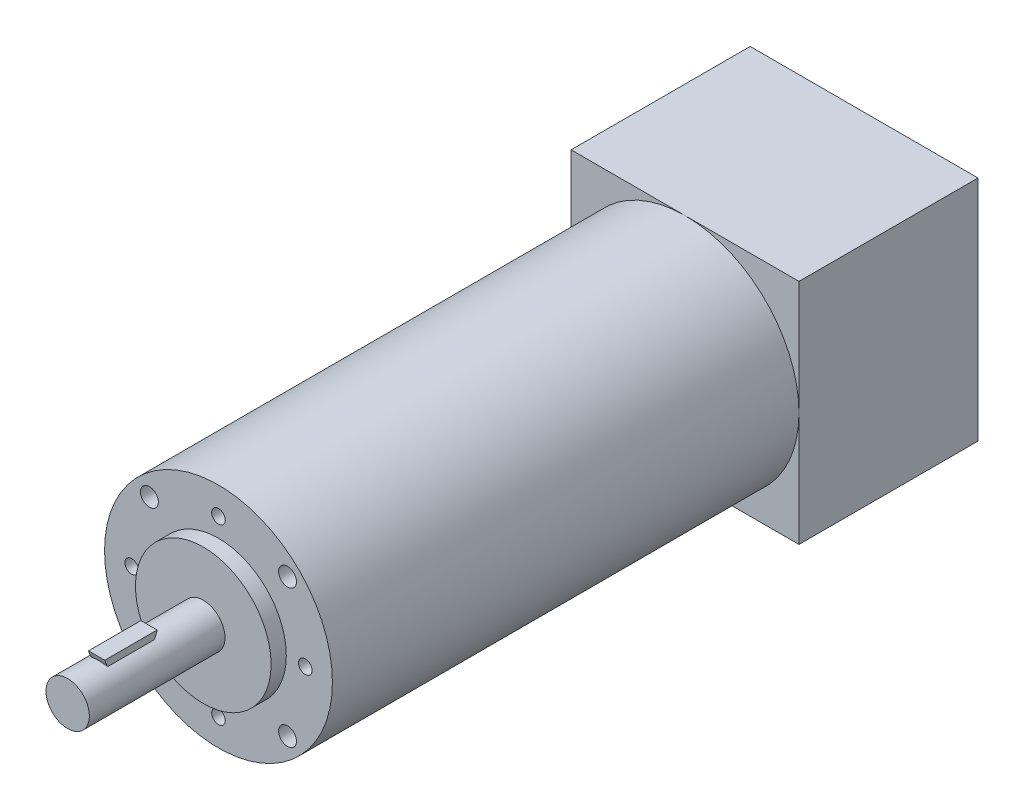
ISO-10303-21;
HEADER;
FILE_DESCRIPTION(('STEP AP214'),'2;1');
FILE_NAME('part.step','',(''),(''),'','','');
FILE_SCHEMA(('AUTOMOTIVE_DESIGN { 1 0 10303 214 1 1 1 1 }'));
ENDSEC;
DATA;
#1=APPLICATION_CONTEXT('core data for automotive mechanical design processes');
#2=APPLICATION_PROTOCOL_DEFINITION('international standard','automotive_design',2000,#1);
#3=PRODUCT_CONTEXT('',#1,'mechanical');
#4=PRODUCT('Part','Part','',(#3));
#5=PRODUCT_RELATED_PRODUCT_CATEGORY('part','',(#4));
#6=PRODUCT_DEFINITION_FORMATION('','',#4);
#7=PRODUCT_DEFINITION_CONTEXT('part definition',#1,'design');
#8=PRODUCT_DEFINITION('design','',#6,#7);
#9=PRODUCT_DEFINITION_SHAPE('','',#8);
#10=(LENGTH_UNIT() NAMED_UNIT(*) SI_UNIT(.MILLI.,.METRE.));
#11=(NAMED_UNIT(*) PLANE_ANGLE_UNIT() SI_UNIT($,.RADIAN.));
#12=(NAMED_UNIT(*) SI_UNIT($,.STERADIAN.) SOLID_ANGLE_UNIT());
#13=UNCERTAINTY_MEASURE_WITH_UNIT(LENGTH_MEASURE(1.E-05),#10,'distance_accuracy_value','');
#14=(GEOMETRIC_REPRESENTATION_CONTEXT(3) GLOBAL_UNCERTAINTY_ASSIGNED_CONTEXT((#13)) GLOBAL_UNIT_ASSIGNED_CONTEXT((#10,
#11,#12)) REPRESENTATION_CONTEXT('',''));
#15=CARTESIAN_POINT('',(0.,0.,0.));
#16=DIRECTION('',(0.,0.,1.));
#17=DIRECTION('',(1.,0.,0.));
#18=AXIS2_PLACEMENT_3D('',#15,#16,#17);
#19=CARTESIAN_POINT('',(0.,-5.34294830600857E-13,45.8000000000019));
#20=DIRECTION('',(0.,0.,1.));
#21=DIRECTION('',(1.,0.,0.));
#22=AXIS2_PLACEMENT_3D('',#19,#20,#21);
#23=PLANE('',#22);
#24=CARTESIAN_POINT('',(0.,-5.34294830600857E-13,45.8000000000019));
#25=DIRECTION('',(0.,0.,1.));
#26=DIRECTION('',(1.,0.,0.));
#27=AXIS2_PLACEMENT_3D('',#24,#25,#26);
#28=CIRCLE('',#27,12.5);
#29=CARTESIAN_POINT('',(12.5,-5.34294830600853E-13,45.8000000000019));
#30=VERTEX_POINT('',#29);
#31=EDGE_CURVE('E205',#30,#30,#28,.T.);
#32=ORIENTED_EDGE('',*,*,#31,.T.);
#33=EDGE_LOOP('',(#32));
#34=FACE_BOUND('',#33,.T.);
#35=CARTESIAN_POINT('',(0.,-5.34294830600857E-13,45.8000000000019));
#36=DIRECTION('',(0.,0.,1.));
#37=DIRECTION('',(1.,0.,0.));
#38=AXIS2_PLACEMENT_3D('',#35,#36,#37);
#39=CIRCLE('',#38,4.);
#40=CARTESIAN_POINT('',(4.,-5.34294830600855E-13,45.8000000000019));
#41=VERTEX_POINT('',#40);
#42=EDGE_CURVE('E196',#41,#41,#39,.T.);
#43=ORIENTED_EDGE('',*,*,#42,.F.);
#44=EDGE_LOOP('',(#43));
#45=FACE_BOUND('',#44,.T.);
#46=ADVANCED_FACE('F28',(#34,#45),#23,.T.);
#47=CARTESIAN_POINT('',(0.,-5.759281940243E-13,43.0000000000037));
#48=DIRECTION('',(0.,0.,1.));
#49=DIRECTION('',(1.,0.,0.));
#50=AXIS2_PLACEMENT_3D('',#47,#48,#49);
#51=PLANE('',#50);
#52=CARTESIAN_POINT('',(-12.7279220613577,-12.7279220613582,43.0000000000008));
#53=DIRECTION('',(0.,0.,1.));
#54=DIRECTION('',(1.,0.,0.));
#55=AXIS2_PLACEMENT_3D('',#52,#53,#54);
#56=CIRCLE('',#55,1.65);
#57=CARTESIAN_POINT('',(-11.0779220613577,-12.7279220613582,43.0000000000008));
#58=VERTEX_POINT('',#57);
#59=EDGE_CURVE('E131',#58,#58,#56,.T.);
#60=ORIENTED_EDGE('',*,*,#59,.F.);
#61=EDGE_LOOP('',(#60));
#62=FACE_BOUND('',#61,.T.);
#63=CARTESIAN_POINT('',(12.7279220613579,12.7279220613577,43.0000000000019));
#64=DIRECTION('',(0.,0.,1.));
#65=DIRECTION('',(1.,0.,0.));
#66=AXIS2_PLACEMENT_3D('',#63,#64,#65);
#67=CIRCLE('',#66,1.65);
#68=CARTESIAN_POINT('',(14.3779220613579,12.7279220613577,43.0000000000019));
#69=VERTEX_POINT('',#68);
#70=EDGE_CURVE('E139',#69,#69,#67,.T.);
#71=ORIENTED_EDGE('',*,*,#70,.F.);
#72=EDGE_LOOP('',(#71));
#73=FACE_BOUND('',#72,.T.);
#74=CARTESIAN_POINT('',(-12.7279220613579,12.7279220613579,43.0000000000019));
#75=DIRECTION('',(0.,0.,1.));
#76=DIRECTION('',(1.,0.,0.));
#77=AXIS2_PLACEMENT_3D('',#74,#75,#76);
#78=CIRCLE('',#77,1.65);
#79=CARTESIAN_POINT('',(-11.0779220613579,12.7279220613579,43.0000000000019));
#80=VERTEX_POINT('',#79);
#81=EDGE_CURVE('E145',#80,#80,#78,.T.);
#82=ORIENTED_EDGE('',*,*,#81,.F.);
#83=EDGE_LOOP('',(#82));
#84=FACE_BOUND('',#83,.T.);
#85=CARTESIAN_POINT('',(12.727922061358,-12.7279220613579,43.0000000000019));
#86=DIRECTION('',(0.,0.,1.));
#87=DIRECTION('',(1.,0.,0.));
#88=AXIS2_PLACEMENT_3D('',#85,#86,#87);
#89=CIRCLE('',#88,1.65);
#90=CARTESIAN_POINT('',(14.377922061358,-12.7279220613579,43.0000000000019));
#91=VERTEX_POINT('',#90);
#92=EDGE_CURVE('E151',#91,#91,#89,.T.);
#93=ORIENTED_EDGE('',*,*,#92,.F.);
#94=EDGE_LOOP('',(#93));
#95=FACE_BOUND('',#94,.T.);
#96=CARTESIAN_POINT('',(16.,-7.70217223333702E-13,43.0000000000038));
#97=DIRECTION('',(0.,0.,1.));
#98=DIRECTION('',(1.,0.,0.));
#99=AXIS2_PLACEMENT_3D('',#96,#97,#98);
#100=CIRCLE('',#99,1.25);
#101=CARTESIAN_POINT('',(17.25,-7.70217223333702E-13,43.0000000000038));
#102=VERTEX_POINT('',#101);
#103=EDGE_CURVE('E157',#102,#102,#100,.T.);
#104=ORIENTED_EDGE('',*,*,#103,.F.);
#105=EDGE_LOOP('',(#104));
#106=FACE_BOUND('',#105,.T.);
#107=CARTESIAN_POINT('',(0.,15.9999999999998,43.0000000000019));
#108=DIRECTION('',(0.,0.,1.));
#109=DIRECTION('',(1.,0.,0.));
#110=AXIS2_PLACEMENT_3D('',#107,#108,#109);
#111=CIRCLE('',#110,1.25);
#112=CARTESIAN_POINT('',(1.25000000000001,15.9999999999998,43.0000000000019));
#113=VERTEX_POINT('',#112);
#114=EDGE_CURVE('E163',#113,#113,#111,.T.);
#115=ORIENTED_EDGE('',*,*,#114,.F.);
#116=EDGE_LOOP('',(#115));
#117=FACE_BOUND('',#116,.T.);
#118=CARTESIAN_POINT('',(-16.,-3.33066907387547E-13,43.0000000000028));
#119=DIRECTION('',(0.,0.,1.));
#120=DIRECTION('',(1.,0.,0.));
#121=AXIS2_PLACEMENT_3D('',#118,#119,#120);
#122=CIRCLE('',#121,1.25);
#123=CARTESIAN_POINT('',(-14.75,-3.33066907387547E-13,43.0000000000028));
#124=VERTEX_POINT('',#123);
#125=EDGE_CURVE('E169',#124,#124,#122,.T.);
#126=ORIENTED_EDGE('',*,*,#125,.F.);
#127=EDGE_LOOP('',(#126));
#128=FACE_BOUND('',#127,.T.);
#129=CARTESIAN_POINT('',(0.,-16.0000000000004,43.0000000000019));
#130=DIRECTION('',(0.,0.,1.));
#131=DIRECTION('',(1.,0.,0.));
#132=AXIS2_PLACEMENT_3D('',#129,#130,#131);
#133=CIRCLE('',#132,1.25);
#134=CARTESIAN_POINT('',(1.25,-16.0000000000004,43.0000000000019));
#135=VERTEX_POINT('',#134);
#136=EDGE_CURVE('E175',#135,#135,#133,.T.);
#137=ORIENTED_EDGE('',*,*,#136,.F.);
#138=EDGE_LOOP('',(#137));
#139=FACE_BOUND('',#138,.T.);
#140=CARTESIAN_POINT('',(0.,-5.759281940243E-13,43.0000000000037));
#141=DIRECTION('',(0.,0.,1.));
#142=DIRECTION('',(1.,0.,0.));
#143=AXIS2_PLACEMENT_3D('',#140,#141,#142);
#144=CIRCLE('',#143,21.);
#145=CARTESIAN_POINT('',(21.,-5.75928194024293E-13,43.0000000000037));
#146=VERTEX_POINT('',#145);
#147=EDGE_CURVE('E248',#146,#146,#144,.T.);
#148=ORIENTED_EDGE('',*,*,#147,.T.);
#149=EDGE_LOOP('',(#148));
#150=FACE_BOUND('',#149,.T.);
#151=CARTESIAN_POINT('',(0.,-5.759281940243E-13,43.0000000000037));
#152=DIRECTION('',(0.,0.,1.));
#153=DIRECTION('',(1.,0.,0.));
#154=AXIS2_PLACEMENT_3D('',#151,#152,#153);
#155=CIRCLE('',#154,12.5);
#156=CARTESIAN_POINT('',(12.5,-5.75928194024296E-13,43.0000000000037));
#157=VERTEX_POINT('',#156);
#158=EDGE_CURVE('E202',#157,#157,#155,.T.);
#159=ORIENTED_EDGE('',*,*,#158,.F.);
#160=EDGE_LOOP('',(#159));
#161=FACE_BOUND('',#160,.T.);
#162=ADVANCED_FACE('F285',(#62,#73,#84,#95,#106,#117,#128,#139,#150,#161),#51,.T.);
#163=CARTESIAN_POINT('',(0.,-5.759281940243E-13,43.0000000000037));
#164=DIRECTION('',(0.,0.,-1.));
#165=DIRECTION('',(-1.,0.,0.));
#166=AXIS2_PLACEMENT_3D('',#163,#164,#165);
#167=CYLINDRICAL_SURFACE('',#166,21.);
#168=ORIENTED_EDGE('',*,*,#147,.F.);
#169=EDGE_LOOP('',(#168));
#170=FACE_BOUND('',#169,.T.);
#171=CARTESIAN_POINT('',(0.,-4.71844785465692E-13,-42.9999999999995));
#172=DIRECTION('',(0.,0.,1.));
#173=DIRECTION('',(1.,0.,0.));
#174=AXIS2_PLACEMENT_3D('',#171,#172,#173);
#175=CIRCLE('',#174,21.);
#176=CARTESIAN_POINT('',(21.,-2.4980018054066E-13,-42.9999999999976));
#177=VERTEX_POINT('',#176);
#178=CARTESIAN_POINT('',(0.,20.9999999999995,-43.));
#179=VERTEX_POINT('',#178);
#180=EDGE_CURVE('E245',#177,#179,#175,.T.);
#181=ORIENTED_EDGE('',*,*,#180,.T.);
#182=CARTESIAN_POINT('',(-21.,-4.85722573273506E-13,-42.9999999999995));
#183=VERTEX_POINT('',#182);
#184=EDGE_CURVE('E249',#179,#183,#175,.T.);
#185=ORIENTED_EDGE('',*,*,#184,.T.);
#186=CARTESIAN_POINT('',(0.,-21.0000000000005,-43.));
#187=VERTEX_POINT('',#186);
#188=EDGE_CURVE('E338',#183,#187,#175,.T.);
#189=ORIENTED_EDGE('',*,*,#188,.T.);
#190=EDGE_CURVE('E244',#187,#177,#175,.T.);
#191=ORIENTED_EDGE('',*,*,#190,.T.);
#192=EDGE_LOOP('',(#181,#185,#189,#191));
#193=FACE_BOUND('',#192,.T.);
#194=ADVANCED_FACE('F30',(#170,#193),#167,.T.);
#195=CARTESIAN_POINT('',(-21.,20.9999999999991,-43.));
#196=DIRECTION('',(0.,0.,1.));
#197=DIRECTION('',(1.,0.,0.));
#198=AXIS2_PLACEMENT_3D('',#195,#196,#197);
#199=PLANE('',#198);
#200=ORIENTED_EDGE('',*,*,#180,.F.);
#201=DIRECTION('',(0.,-1.,0.));
#202=VECTOR('',#201,1.);
#203=CARTESIAN_POINT('',(21.,-21.0000000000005,-42.9999999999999));
#204=LINE('',#203,#202);
#205=CARTESIAN_POINT('',(21.,21.,-43.));
#206=VERTEX_POINT('',#205);
#207=EDGE_CURVE('E217',#206,#177,#204,.T.);
#208=ORIENTED_EDGE('',*,*,#207,.F.);
#209=DIRECTION('',(1.,0.,0.));
#210=VECTOR('',#209,1.);
#211=CARTESIAN_POINT('',(21.,21.,-43.));
#212=LINE('',#211,#210);
#213=EDGE_CURVE('E212',#179,#206,#212,.T.);
#214=ORIENTED_EDGE('',*,*,#213,.F.);
#215=EDGE_LOOP('',(#200,#208,#214));
#216=FACE_BOUND('',#215,.T.);
#217=ADVANCED_FACE('F297',(#216),#199,.T.);
#218=ORIENTED_EDGE('',*,*,#184,.F.);
#219=CARTESIAN_POINT('',(-21.,20.9999999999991,-43.));
#220=VERTEX_POINT('',#219);
#221=EDGE_CURVE('E213',#220,#179,#212,.T.);
#222=ORIENTED_EDGE('',*,*,#221,.F.);
#223=DIRECTION('',(0.,1.,0.));
#224=VECTOR('',#223,1.);
#225=CARTESIAN_POINT('',(-21.,-21.0000000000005,-43.));
#226=LINE('',#225,#224);
#227=EDGE_CURVE('E208',#183,#220,#226,.T.);
#228=ORIENTED_EDGE('',*,*,#227,.F.);
#229=EDGE_LOOP('',(#218,#222,#228));
#230=FACE_BOUND('',#229,.T.);
#231=ADVANCED_FACE('F300',(#230),#199,.T.);
#232=ORIENTED_EDGE('',*,*,#188,.F.);
#233=CARTESIAN_POINT('',(-21.,-21.0000000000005,-43.));
#234=VERTEX_POINT('',#233);
#235=EDGE_CURVE('E209',#234,#183,#226,.T.);
#236=ORIENTED_EDGE('',*,*,#235,.F.);
#237=DIRECTION('',(-1.,0.,0.));
#238=VECTOR('',#237,1.);
#239=CARTESIAN_POINT('',(21.,-21.0000000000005,-42.9999999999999));
#240=LINE('',#239,#238);
#241=EDGE_CURVE('E219',#187,#234,#240,.T.);
#242=ORIENTED_EDGE('',*,*,#241,.F.);
#243=EDGE_LOOP('',(#232,#236,#242));
#244=FACE_BOUND('',#243,.T.);
#245=ADVANCED_FACE('F324',(#244),#199,.T.);
#246=ORIENTED_EDGE('',*,*,#190,.F.);
#247=CARTESIAN_POINT('',(21.,-21.0000000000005,-42.9999999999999));
#248=VERTEX_POINT('',#247);
#249=EDGE_CURVE('E220',#248,#187,#240,.T.);
#250=ORIENTED_EDGE('',*,*,#249,.F.);
#251=EDGE_CURVE('E216',#177,#248,#204,.T.);
#252=ORIENTED_EDGE('',*,*,#251,.F.);
#253=EDGE_LOOP('',(#246,#250,#252));
#254=FACE_BOUND('',#253,.T.);
#255=ADVANCED_FACE('F302',(#254),#199,.T.);
#256=CARTESIAN_POINT('',(-20.9999999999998,-21.0000000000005,-75.9999999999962));
#257=DIRECTION('',(1.,0.,0.));
#258=DIRECTION('',(0.,0.,-1.));
#259=AXIS2_PLACEMENT_3D('',#256,#257,#258);
#260=PLANE('',#259);
#261=ORIENTED_EDGE('',*,*,#235,.T.);
#262=ORIENTED_EDGE('',*,*,#227,.T.);
#263=DIRECTION('',(0.,0.,1.));
#264=VECTOR('',#263,1.);
#265=CARTESIAN_POINT('',(-21.,20.9999999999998,-75.9999999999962));
#266=LINE('',#265,#264);
#267=CARTESIAN_POINT('',(-21.,20.9999999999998,-75.9999999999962));
#268=VERTEX_POINT('',#267);
#269=EDGE_CURVE('E241',#268,#220,#266,.T.);
#270=ORIENTED_EDGE('',*,*,#269,.F.);
#271=DIRECTION('',(0.,1.,0.));
#272=VECTOR('',#271,1.);
#273=CARTESIAN_POINT('',(-20.9999999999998,-21.0000000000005,-75.9999999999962));
#274=LINE('',#273,#272);
#275=CARTESIAN_POINT('',(-20.9999999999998,-21.0000000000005,-75.9999999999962));
#276=VERTEX_POINT('',#275);
#277=EDGE_CURVE('E223',#276,#268,#274,.T.);
#278=ORIENTED_EDGE('',*,*,#277,.F.);
#279=DIRECTION('',(0.,0.,1.));
#280=VECTOR('',#279,1.);
#281=CARTESIAN_POINT('',(-20.9999999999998,-21.0000000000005,-75.9999999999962));
#282=LINE('',#281,#280);
#283=EDGE_CURVE('E232',#276,#234,#282,.T.);
#284=ORIENTED_EDGE('',*,*,#283,.T.);
#285=EDGE_LOOP('',(#261,#262,#270,#278,#284));
#286=FACE_BOUND('',#285,.T.);
#287=ADVANCED_FACE('F317',(#286),#260,.F.);
#288=CARTESIAN_POINT('',(21.,21.,-75.9999999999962));
#289=DIRECTION('',(0.,-1.,0.));
#290=DIRECTION('',(0.,0.,-1.));
#291=AXIS2_PLACEMENT_3D('',#288,#289,#290);
#292=PLANE('',#291);
#293=ORIENTED_EDGE('',*,*,#221,.T.);
#294=ORIENTED_EDGE('',*,*,#213,.T.);
#295=DIRECTION('',(0.,0.,1.));
#296=VECTOR('',#295,1.);
#297=CARTESIAN_POINT('',(21.,21.,-75.9999999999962));
#298=LINE('',#297,#296);
#299=CARTESIAN_POINT('',(21.,21.,-75.9999999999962));
#300=VERTEX_POINT('',#299);
#301=EDGE_CURVE('E238',#300,#206,#298,.T.);
#302=ORIENTED_EDGE('',*,*,#301,.F.);
#303=DIRECTION('',(1.,0.,0.));
#304=VECTOR('',#303,1.);
#305=CARTESIAN_POINT('',(21.,21.,-75.9999999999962));
#306=LINE('',#305,#304);
#307=EDGE_CURVE('E226',#268,#300,#306,.T.);
#308=ORIENTED_EDGE('',*,*,#307,.F.);
#309=ORIENTED_EDGE('',*,*,#269,.T.);
#310=EDGE_LOOP('',(#293,#294,#302,#308,#309));
#311=FACE_BOUND('',#310,.T.);
#312=ADVANCED_FACE('F313',(#311),#292,.F.);
#313=CARTESIAN_POINT('',(21.0000000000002,-21.0000000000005,-75.9999999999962));
#314=DIRECTION('',(-1.,0.,0.));
#315=DIRECTION('',(0.,0.,1.));
#316=AXIS2_PLACEMENT_3D('',#313,#314,#315);
#317=PLANE('',#316);
#318=ORIENTED_EDGE('',*,*,#207,.T.);
#319=ORIENTED_EDGE('',*,*,#251,.T.);
#320=DIRECTION('',(0.,0.,1.));
#321=VECTOR('',#320,1.);
#322=CARTESIAN_POINT('',(21.0000000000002,-21.0000000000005,-75.9999999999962));
#323=LINE('',#322,#321);
#324=CARTESIAN_POINT('',(21.0000000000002,-21.0000000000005,-75.9999999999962));
#325=VERTEX_POINT('',#324);
#326=EDGE_CURVE('E235',#325,#248,#323,.T.);
#327=ORIENTED_EDGE('',*,*,#326,.F.);
#328=DIRECTION('',(0.,-1.,0.));
#329=VECTOR('',#328,1.);
#330=CARTESIAN_POINT('',(21.0000000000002,-21.0000000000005,-75.9999999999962));
#331=LINE('',#330,#329);
#332=EDGE_CURVE('E228',#300,#325,#331,.T.);
#333=ORIENTED_EDGE('',*,*,#332,.F.);
#334=ORIENTED_EDGE('',*,*,#301,.T.);
#335=EDGE_LOOP('',(#318,#319,#327,#333,#334));
#336=FACE_BOUND('',#335,.T.);
#337=ADVANCED_FACE('F309',(#336),#317,.F.);
#338=CARTESIAN_POINT('',(21.0000000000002,-21.0000000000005,-75.9999999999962));
#339=DIRECTION('',(0.,1.,0.));
#340=DIRECTION('',(0.,0.,1.));
#341=AXIS2_PLACEMENT_3D('',#338,#339,#340);
#342=PLANE('',#341);
#343=ORIENTED_EDGE('',*,*,#249,.T.);
#344=ORIENTED_EDGE('',*,*,#241,.T.);
#345=ORIENTED_EDGE('',*,*,#283,.F.);
#346=DIRECTION('',(-1.,0.,0.));
#347=VECTOR('',#346,1.);
#348=CARTESIAN_POINT('',(21.0000000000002,-21.0000000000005,-75.9999999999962));
#349=LINE('',#348,#347);
#350=EDGE_CURVE('E230',#325,#276,#349,.T.);
#351=ORIENTED_EDGE('',*,*,#350,.F.);
#352=ORIENTED_EDGE('',*,*,#326,.T.);
#353=EDGE_LOOP('',(#343,#344,#345,#351,#352));
#354=FACE_BOUND('',#353,.T.);
#355=ADVANCED_FACE('F305',(#354),#342,.F.);
#356=CARTESIAN_POINT('',(-21.,20.9999999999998,-75.9999999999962));
#357=DIRECTION('',(0.,0.,1.));
#358=DIRECTION('',(1.,0.,0.));
#359=AXIS2_PLACEMENT_3D('',#356,#357,#358);
#360=PLANE('',#359);
#361=ORIENTED_EDGE('',*,*,#277,.T.);
#362=ORIENTED_EDGE('',*,*,#307,.T.);
#363=ORIENTED_EDGE('',*,*,#332,.T.);
#364=ORIENTED_EDGE('',*,*,#350,.T.);
#365=EDGE_LOOP('',(#361,#362,#363,#364));
#366=FACE_BOUND('',#365,.T.);
#367=ADVANCED_FACE('F295',(#366),#360,.F.);
#368=CARTESIAN_POINT('',(0.,-5.34294830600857E-13,45.8000000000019));
#369=DIRECTION('',(0.,0.,-1.));
#370=DIRECTION('',(-1.,0.,0.));
#371=AXIS2_PLACEMENT_3D('',#368,#369,#370);
#372=CYLINDRICAL_SURFACE('',#371,12.5);
#373=ORIENTED_EDGE('',*,*,#31,.F.);
#374=EDGE_LOOP('',(#373));
#375=FACE_BOUND('',#374,.T.);
#376=ORIENTED_EDGE('',*,*,#158,.T.);
#377=EDGE_LOOP('',(#376));
#378=FACE_BOUND('',#377,.T.);
#379=ADVANCED_FACE('F283',(#375,#378),#372,.T.);
#380=CARTESIAN_POINT('',(0.,-4.92661467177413E-13,70.8000000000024));
#381=DIRECTION('',(0.,0.,-1.));
#382=DIRECTION('',(-1.,0.,0.));
#383=AXIS2_PLACEMENT_3D('',#380,#381,#382);
#384=CYLINDRICAL_SURFACE('',#383,4.);
#385=CARTESIAN_POINT('',(1.49999999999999,3.70809924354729,56.3528103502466));
#386=CARTESIAN_POINT('',(1.41061932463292,3.74427794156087,56.3308859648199));
#387=CARTESIAN_POINT('',(1.31941136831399,3.77739059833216,56.3114081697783));
#388=CARTESIAN_POINT('',(1.13406692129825,3.83709850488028,56.2770342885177));
#389=CARTESIAN_POINT('',(1.03993106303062,3.86369515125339,56.2621372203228));
#390=CARTESIAN_POINT('',(0.849433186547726,3.90999784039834,56.2366062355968));
#391=CARTESIAN_POINT('',(0.753071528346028,3.92970498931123,56.2259716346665));
#392=CARTESIAN_POINT('',(0.558806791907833,3.96199794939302,56.2087238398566));
#393=CARTESIAN_POINT('',(0.460903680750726,3.97458360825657,56.2021107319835));
#394=CARTESIAN_POINT('',(0.264265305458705,3.99248171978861,56.1927470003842));
#395=CARTESIAN_POINT('',(0.16553015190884,3.99779512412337,56.1899958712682));
#396=CARTESIAN_POINT('',(-0.0320948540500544,4.00109198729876,56.188286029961));
#397=CARTESIAN_POINT('',(-0.130984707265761,3.9990754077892,56.1893273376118));
#398=CARTESIAN_POINT('',(-0.328135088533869,3.98773929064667,56.1952259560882));
#399=CARTESIAN_POINT('',(-0.426396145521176,3.97842703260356,56.2000794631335));
#400=CARTESIAN_POINT('',(-0.621657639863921,3.95262480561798,56.2137130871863));
#401=CARTESIAN_POINT('',(-0.718658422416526,3.93613684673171,56.2224921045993));
#402=CARTESIAN_POINT('',(-0.932740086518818,3.89159454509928,56.2466666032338));
#403=CARTESIAN_POINT('',(-1.04934282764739,3.86175785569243,56.263115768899));
#404=CARTESIAN_POINT('',(-1.22099601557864,3.80956053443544,56.2928437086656));
#405=CARTESIAN_POINT('',(-1.27765752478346,3.7909268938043,56.3035919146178));
#406=CARTESIAN_POINT('',(-1.38977054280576,3.75127619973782,56.3268553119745));
#407=CARTESIAN_POINT('',(-1.44522205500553,3.73025915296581,56.339370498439));
#408=CARTESIAN_POINT('',(-1.50000000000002,3.70809924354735,56.3528103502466));
#409=B_SPLINE_CURVE_WITH_KNOTS('',3,(#385,#386,#387,#388,#389,#390,#391,#392,#393,#394,#395,
#396,#397,#398,#399,#400,#401,#402,#403,#404,#405,#406,#407,#408),.UNSPECIFIED.,.F.,.F.,(4,2,2,
2,2,2,2,2,2,2,2,4),(0.,0.29654722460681,0.593030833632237,0.889466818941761,1.18590914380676,
1.482312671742,1.77871775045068,2.07482745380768,2.37085426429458,2.73454533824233,
2.91629579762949,3.09804574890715),.UNSPECIFIED.);
#410=CARTESIAN_POINT('',(1.49999999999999,3.70809924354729,56.3528103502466));
#411=VERTEX_POINT('',#410);
#412=CARTESIAN_POINT('',(-1.50000000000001,3.70809924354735,56.3528103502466));
#413=VERTEX_POINT('',#412);
#414=EDGE_CURVE('E36',#411,#413,#409,.T.);
#415=ORIENTED_EDGE('',*,*,#414,.F.);
#416=DIRECTION('',(0.,0.,-1.));
#417=VECTOR('',#416,1.);
#418=CARTESIAN_POINT('',(1.49999999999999,3.70809924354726,70.8000000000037));
#419=LINE('',#418,#417);
#420=CARTESIAN_POINT('',(1.49999999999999,3.70809924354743,64.9071896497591));
#421=VERTEX_POINT('',#420);
#422=EDGE_CURVE('E11',#411,#421,#419,.F.);
#423=ORIENTED_EDGE('',*,*,#422,.T.);
#424=CARTESIAN_POINT('',(-1.50000000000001,3.70809924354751,64.9071896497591));
#425=CARTESIAN_POINT('',(-1.41061932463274,3.74427794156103,64.9291140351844));
#426=CARTESIAN_POINT('',(-1.31941136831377,3.77739059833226,64.9485918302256));
#427=CARTESIAN_POINT('',(-1.13406692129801,3.83709850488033,64.982965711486));
#428=CARTESIAN_POINT('',(-1.0399310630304,3.86369515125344,64.9978627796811));
#429=CARTESIAN_POINT('',(-0.849433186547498,3.9099978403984,65.0233937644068));
#430=CARTESIAN_POINT('',(-0.753071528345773,3.92970498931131,65.0340283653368));
#431=CARTESIAN_POINT('',(-0.558806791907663,3.96199794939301,65.0512761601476));
#432=CARTESIAN_POINT('',(-0.460903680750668,3.97458360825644,65.0578892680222));
#433=CARTESIAN_POINT('',(-0.26426530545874,3.99248171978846,65.0672529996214));
#434=CARTESIAN_POINT('',(-0.165530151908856,3.99779512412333,65.0700041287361));
#435=CARTESIAN_POINT('',(0.0320948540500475,4.00109198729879,65.0717139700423));
#436=CARTESIAN_POINT('',(0.130984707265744,3.9990754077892,65.070672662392));
#437=CARTESIAN_POINT('',(0.328135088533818,3.98773929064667,65.0647740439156));
#438=CARTESIAN_POINT('',(0.4263961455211,3.97842703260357,65.0599205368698));
#439=CARTESIAN_POINT('',(0.621657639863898,3.95262480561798,65.0462869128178));
#440=CARTESIAN_POINT('',(0.718658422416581,3.93613684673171,65.0375078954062));
#441=CARTESIAN_POINT('',(0.932740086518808,3.8915945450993,65.013333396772));
#442=CARTESIAN_POINT('',(1.04934282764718,3.86175785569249,64.9968842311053));
#443=CARTESIAN_POINT('',(1.22099601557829,3.80956053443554,64.9671562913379));
#444=CARTESIAN_POINT('',(1.27765752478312,3.79092689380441,64.9564080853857));
#445=CARTESIAN_POINT('',(1.38977054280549,3.75127619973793,64.9331446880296));
#446=CARTESIAN_POINT('',(1.44522205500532,3.73025915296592,64.9206295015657));
#447=CARTESIAN_POINT('',(1.49999999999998,3.70809924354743,64.9071896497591));
#448=B_SPLINE_CURVE_WITH_KNOTS('',3,(#424,#425,#426,#427,#428,#429,#430,#431,#432,#433,#434,
#435,#436,#437,#438,#439,#440,#441,#442,#443,#444,#445,#446,#447),.UNSPECIFIED.,.F.,.F.,(4,2,2,
2,2,2,2,2,2,2,2,4),(0.,0.296547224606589,0.593030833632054,0.889466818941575,1.18590914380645,
1.48231267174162,1.77871775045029,2.07482745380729,2.37085426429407,2.73454533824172,
2.91629579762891,3.09804574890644),.UNSPECIFIED.);
#449=CARTESIAN_POINT('',(-1.50000000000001,3.70809924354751,64.9071896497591));
#450=VERTEX_POINT('',#449);
#451=EDGE_CURVE('E255',#450,#421,#448,.T.);
#452=ORIENTED_EDGE('',*,*,#451,.F.);
#453=DIRECTION('',(0.,0.,-1.));
#454=VECTOR('',#453,1.);
#455=CARTESIAN_POINT('',(-1.50000000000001,3.70809924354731,70.8000000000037));
#456=LINE('',#455,#454);
#457=EDGE_CURVE('E252',#413,#450,#456,.F.);
#458=ORIENTED_EDGE('',*,*,#457,.F.);
#459=EDGE_LOOP('',(#415,#423,#452,#458));
#460=FACE_BOUND('',#459,.T.);
#461=CARTESIAN_POINT('',(0.,-4.92661467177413E-13,70.8000000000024));
#462=DIRECTION('',(0.,0.,1.));
#463=DIRECTION('',(1.,0.,0.));
#464=AXIS2_PLACEMENT_3D('',#461,#462,#463);
#465=CIRCLE('',#464,4.);
#466=CARTESIAN_POINT('',(4.,-4.92661467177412E-13,70.8000000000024));
#467=VERTEX_POINT('',#466);
#468=EDGE_CURVE('E199',#467,#467,#465,.T.);
#469=ORIENTED_EDGE('',*,*,#468,.F.);
#470=EDGE_LOOP('',(#469));
#471=FACE_BOUND('',#470,.T.);
#472=ORIENTED_EDGE('',*,*,#42,.T.);
#473=EDGE_LOOP('',(#472));
#474=FACE_BOUND('',#473,.T.);
#475=ADVANCED_FACE('F264',(#460,#471,#474),#384,.T.);
#476=CARTESIAN_POINT('',(0.,-4.92661467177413E-13,70.8000000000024));
#477=DIRECTION('',(0.,0.,1.));
#478=DIRECTION('',(1.,0.,0.));
#479=AXIS2_PLACEMENT_3D('',#476,#477,#478);
#480=PLANE('',#479);
#481=ORIENTED_EDGE('',*,*,#468,.T.);
#482=EDGE_LOOP('',(#481));
#483=FACE_BOUND('',#482,.T.);
#484=ADVANCED_FACE('F273',(#483),#480,.T.);
#485=CARTESIAN_POINT('',(1.5,6.3025540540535,60.6300000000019));
#486=DIRECTION('',(-1.,0.,0.));
#487=DIRECTION('',(0.,0.,1.));
#488=AXIS2_PLACEMENT_3D('',#485,#486,#487);
#489=CYLINDRICAL_SURFACE('',#488,5.00255405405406);
#490=CARTESIAN_POINT('',(1.5,6.3025540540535,60.6300000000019));
#491=DIRECTION('',(1.,0.,0.));
#492=DIRECTION('',(0.,0.,-1.));
#493=AXIS2_PLACEMENT_3D('',#490,#491,#492);
#494=CIRCLE('',#493,5.00255405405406);
#495=CARTESIAN_POINT('',(1.49999999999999,4.99999999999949,55.8000000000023));
#496=VERTEX_POINT('',#495);
#497=EDGE_CURVE('E184',#411,#496,#494,.T.);
#498=ORIENTED_EDGE('',*,*,#497,.F.);
#499=ORIENTED_EDGE('',*,*,#414,.T.);
#500=CARTESIAN_POINT('',(-1.5,6.3025540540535,60.6300000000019));
#501=DIRECTION('',(1.,0.,0.));
#502=DIRECTION('',(0.,0.,-1.));
#503=AXIS2_PLACEMENT_3D('',#500,#501,#502);
#504=CIRCLE('',#503,5.00255405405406);
#505=CARTESIAN_POINT('',(-1.50000000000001,4.99999999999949,55.8000000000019));
#506=VERTEX_POINT('',#505);
#507=EDGE_CURVE('E178',#413,#506,#504,.T.);
#508=ORIENTED_EDGE('',*,*,#507,.T.);
#509=DIRECTION('',(-1.,0.,0.));
#510=VECTOR('',#509,1.);
#511=CARTESIAN_POINT('',(1.49999999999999,4.99999999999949,55.8000000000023));
#512=LINE('',#511,#510);
#513=EDGE_CURVE('E193',#496,#506,#512,.T.);
#514=ORIENTED_EDGE('',*,*,#513,.F.);
#515=EDGE_LOOP('',(#498,#499,#508,#514));
#516=FACE_BOUND('',#515,.T.);
#517=ADVANCED_FACE('F268',(#516),#489,.T.);
#518=CARTESIAN_POINT('',(-1.50000000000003,4.99999999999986,65.4600000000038));
#519=VERTEX_POINT('',#518);
#520=EDGE_CURVE('E179',#519,#450,#504,.T.);
#521=ORIENTED_EDGE('',*,*,#520,.T.);
#522=ORIENTED_EDGE('',*,*,#451,.T.);
#523=CARTESIAN_POINT('',(1.49999999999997,4.99999999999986,65.4600000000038));
#524=VERTEX_POINT('',#523);
#525=EDGE_CURVE('E185',#524,#421,#494,.T.);
#526=ORIENTED_EDGE('',*,*,#525,.F.);
#527=DIRECTION('',(-1.,0.,0.));
#528=VECTOR('',#527,1.);
#529=CARTESIAN_POINT('',(1.49999999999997,4.99999999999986,65.4600000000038));
#530=LINE('',#529,#528);
#531=EDGE_CURVE('E190',#524,#519,#530,.T.);
#532=ORIENTED_EDGE('',*,*,#531,.T.);
#533=EDGE_LOOP('',(#521,#522,#526,#532));
#534=FACE_BOUND('',#533,.T.);
#535=ADVANCED_FACE('F272',(#534),#489,.T.);
#536=CARTESIAN_POINT('',(1.5,6.3025540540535,60.6300000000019));
#537=DIRECTION('',(1.,0.,0.));
#538=DIRECTION('',(0.,0.,-1.));
#539=AXIS2_PLACEMENT_3D('',#536,#537,#538);
#540=PLANE('',#539);
#541=ORIENTED_EDGE('',*,*,#422,.F.);
#542=ORIENTED_EDGE('',*,*,#497,.T.);
#543=DIRECTION('',(0.,0.,1.));
#544=VECTOR('',#543,1.);
#545=CARTESIAN_POINT('',(1.49999999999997,4.99999999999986,65.4600000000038));
#546=LINE('',#545,#544);
#547=EDGE_CURVE('E188',#496,#524,#546,.T.);
#548=ORIENTED_EDGE('',*,*,#547,.T.);
#549=ORIENTED_EDGE('',*,*,#525,.T.);
#550=EDGE_LOOP('',(#541,#542,#548,#549));
#551=FACE_BOUND('',#550,.T.);
#552=ADVANCED_FACE('F418',(#551),#540,.T.);
#553=CARTESIAN_POINT('',(-1.5,6.3025540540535,60.6300000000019));
#554=DIRECTION('',(1.,0.,0.));
#555=DIRECTION('',(0.,0.,-1.));
#556=AXIS2_PLACEMENT_3D('',#553,#554,#555);
#557=PLANE('',#556);
#558=ORIENTED_EDGE('',*,*,#507,.F.);
#559=ORIENTED_EDGE('',*,*,#457,.T.);
#560=ORIENTED_EDGE('',*,*,#520,.F.);
#561=DIRECTION('',(0.,0.,1.));
#562=VECTOR('',#561,1.);
#563=CARTESIAN_POINT('',(-1.50000000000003,4.99999999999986,65.4600000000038));
#564=LINE('',#563,#562);
#565=EDGE_CURVE('E182',#506,#519,#564,.T.);
#566=ORIENTED_EDGE('',*,*,#565,.F.);
#567=EDGE_LOOP('',(#558,#559,#560,#566));
#568=FACE_BOUND('',#567,.T.);
#569=ADVANCED_FACE('F412',(#568),#557,.F.);
#570=CARTESIAN_POINT('',(1.49999999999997,4.99999999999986,65.4600000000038));
#571=DIRECTION('',(0.,-1.,0.));
#572=DIRECTION('',(0.,0.,-1.));
#573=AXIS2_PLACEMENT_3D('',#570,#571,#572);
#574=PLANE('',#573);
#575=ORIENTED_EDGE('',*,*,#565,.T.);
#576=ORIENTED_EDGE('',*,*,#531,.F.);
#577=ORIENTED_EDGE('',*,*,#547,.F.);
#578=ORIENTED_EDGE('',*,*,#513,.T.);
#579=EDGE_LOOP('',(#575,#576,#577,#578));
#580=FACE_BOUND('',#579,.T.);
#581=ADVANCED_FACE('F275',(#580),#574,.F.);
#582=CARTESIAN_POINT('',(0.,-16.0000000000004,43.0000000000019));
#583=DIRECTION('',(0.,0.,1.));
#584=DIRECTION('',(1.,0.,0.));
#585=AXIS2_PLACEMENT_3D('',#582,#583,#584);
#586=CYLINDRICAL_SURFACE('',#585,1.25);
#587=CARTESIAN_POINT('',(0.,-16.0000000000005,34.));
#588=DIRECTION('',(0.,0.,1.));
#589=DIRECTION('',(1.,0.,0.));
#590=AXIS2_PLACEMENT_3D('',#587,#588,#589);
#591=CIRCLE('',#590,1.25);
#592=CARTESIAN_POINT('',(1.24999999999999,-16.0000000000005,34.));
#593=VERTEX_POINT('',#592);
#594=EDGE_CURVE('E172',#593,#593,#591,.T.);
#595=ORIENTED_EDGE('',*,*,#594,.F.);
#596=EDGE_LOOP('',(#595));
#597=FACE_BOUND('',#596,.T.);
#598=ORIENTED_EDGE('',*,*,#136,.T.);
#599=EDGE_LOOP('',(#598));
#600=FACE_BOUND('',#599,.T.);
#601=ADVANCED_FACE('F399',(#597,#600),#586,.F.);
#602=CARTESIAN_POINT('',(0.,-16.0000000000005,34.));
#603=DIRECTION('',(0.,0.,1.));
#604=DIRECTION('',(1.,0.,0.));
#605=AXIS2_PLACEMENT_3D('',#602,#603,#604);
#606=CONICAL_SURFACE('',#605,1.25,1.02974425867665);
#607=CARTESIAN_POINT('',(0.,-16.0000000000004,33.2489242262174));
#608=VERTEX_POINT('',#607);
#609=VERTEX_LOOP('',#608);
#610=FACE_BOUND('',#609,.T.);
#611=ORIENTED_EDGE('',*,*,#594,.T.);
#612=EDGE_LOOP('',(#611));
#613=FACE_BOUND('',#612,.T.);
#614=ADVANCED_FACE('F401',(#610,#613),#606,.F.);
#615=CARTESIAN_POINT('',(-16.,-3.33066907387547E-13,43.0000000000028));
#616=DIRECTION('',(0.,0.,1.));
#617=DIRECTION('',(1.,0.,0.));
#618=AXIS2_PLACEMENT_3D('',#615,#616,#617);
#619=CYLINDRICAL_SURFACE('',#618,1.25);
#620=CARTESIAN_POINT('',(-16.,-4.02455846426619E-13,34.0000000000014));
#621=DIRECTION('',(0.,0.,1.));
#622=DIRECTION('',(1.,0.,0.));
#623=AXIS2_PLACEMENT_3D('',#620,#621,#622);
#624=CIRCLE('',#623,1.25);
#625=CARTESIAN_POINT('',(-14.75,-4.02455846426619E-13,34.0000000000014));
#626=VERTEX_POINT('',#625);
#627=EDGE_CURVE('E166',#626,#626,#624,.T.);
#628=ORIENTED_EDGE('',*,*,#627,.F.);
#629=EDGE_LOOP('',(#628));
#630=FACE_BOUND('',#629,.T.);
#631=ORIENTED_EDGE('',*,*,#125,.T.);
#632=EDGE_LOOP('',(#631));
#633=FACE_BOUND('',#632,.T.);
#634=ADVANCED_FACE('F408',(#630,#633),#619,.F.);
#635=CARTESIAN_POINT('',(-16.,-4.02455846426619E-13,34.0000000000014));
#636=DIRECTION('',(0.,0.,1.));
#637=DIRECTION('',(1.,0.,0.));
#638=AXIS2_PLACEMENT_3D('',#635,#636,#637);
#639=CONICAL_SURFACE('',#638,1.25,1.02974425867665);
#640=CARTESIAN_POINT('',(-15.9999999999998,-3.46944695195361E-13,33.2489242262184));
#641=VERTEX_POINT('',#640);
#642=VERTEX_LOOP('',#641);
#643=FACE_BOUND('',#642,.T.);
#644=ORIENTED_EDGE('',*,*,#627,.T.);
#645=EDGE_LOOP('',(#644));
#646=FACE_BOUND('',#645,.T.);
#647=ADVANCED_FACE('F452',(#643,#646),#639,.F.);
#648=CARTESIAN_POINT('',(0.,15.9999999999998,43.0000000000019));
#649=DIRECTION('',(0.,0.,1.));
#650=DIRECTION('',(1.,0.,0.));
#651=AXIS2_PLACEMENT_3D('',#648,#649,#650);
#652=CYLINDRICAL_SURFACE('',#651,1.25);
#653=CARTESIAN_POINT('',(0.,15.9999999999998,34.0000000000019));
#654=DIRECTION('',(0.,0.,1.));
#655=DIRECTION('',(1.,0.,0.));
#656=AXIS2_PLACEMENT_3D('',#653,#654,#655);
#657=CIRCLE('',#656,1.25);
#658=CARTESIAN_POINT('',(1.25000000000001,15.9999999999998,34.0000000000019));
#659=VERTEX_POINT('',#658);
#660=EDGE_CURVE('E160',#659,#659,#657,.T.);
#661=ORIENTED_EDGE('',*,*,#660,.F.);
#662=EDGE_LOOP('',(#661));
#663=FACE_BOUND('',#662,.T.);
#664=ORIENTED_EDGE('',*,*,#114,.T.);
#665=EDGE_LOOP('',(#664));
#666=FACE_BOUND('',#665,.T.);
#667=ADVANCED_FACE('F459',(#663,#666),#652,.F.);
#668=CARTESIAN_POINT('',(0.,15.9999999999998,34.0000000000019));
#669=DIRECTION('',(0.,0.,1.));
#670=DIRECTION('',(1.,0.,0.));
#671=AXIS2_PLACEMENT_3D('',#668,#669,#670);
#672=CONICAL_SURFACE('',#671,1.25,1.02974425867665);
#673=CARTESIAN_POINT('',(0.,15.9999999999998,33.2489242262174));
#674=VERTEX_POINT('',#673);
#675=VERTEX_LOOP('',#674);
#676=FACE_BOUND('',#675,.T.);
#677=ORIENTED_EDGE('',*,*,#660,.T.);
#678=EDGE_LOOP('',(#677));
#679=FACE_BOUND('',#678,.T.);
#680=ADVANCED_FACE('F465',(#676,#679),#672,.F.);
#681=CARTESIAN_POINT('',(16.,-7.70217223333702E-13,43.0000000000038));
#682=DIRECTION('',(0.,0.,1.));
#683=DIRECTION('',(1.,0.,0.));
#684=AXIS2_PLACEMENT_3D('',#681,#682,#683);
#685=CYLINDRICAL_SURFACE('',#684,1.25);
#686=CARTESIAN_POINT('',(16.,-8.18789480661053E-13,34.0000000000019));
#687=DIRECTION('',(0.,0.,1.));
#688=DIRECTION('',(1.,0.,0.));
#689=AXIS2_PLACEMENT_3D('',#686,#687,#688);
#690=CIRCLE('',#689,1.25);
#691=CARTESIAN_POINT('',(17.25,-8.18789480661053E-13,34.0000000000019));
#692=VERTEX_POINT('',#691);
#693=EDGE_CURVE('E154',#692,#692,#690,.T.);
#694=ORIENTED_EDGE('',*,*,#693,.F.);
#695=EDGE_LOOP('',(#694));
#696=FACE_BOUND('',#695,.T.);
#697=ORIENTED_EDGE('',*,*,#103,.T.);
#698=EDGE_LOOP('',(#697));
#699=FACE_BOUND('',#698,.T.);
#700=ADVANCED_FACE('F473',(#696,#699),#685,.F.);
#701=CARTESIAN_POINT('',(16.,-8.18789480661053E-13,34.0000000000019));
#702=DIRECTION('',(0.,0.,1.));
#703=DIRECTION('',(1.,0.,0.));
#704=AXIS2_PLACEMENT_3D('',#701,#702,#703);
#705=CONICAL_SURFACE('',#704,1.25,1.02974425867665);
#706=CARTESIAN_POINT('',(16.0000000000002,-7.84095011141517E-13,33.2489242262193));
#707=VERTEX_POINT('',#706);
#708=VERTEX_LOOP('',#707);
#709=FACE_BOUND('',#708,.T.);
#710=ORIENTED_EDGE('',*,*,#693,.T.);
#711=EDGE_LOOP('',(#710));
#712=FACE_BOUND('',#711,.T.);
#713=ADVANCED_FACE('F479',(#709,#712),#705,.F.);
#714=CARTESIAN_POINT('',(12.727922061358,-12.7279220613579,43.0000000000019));
#715=DIRECTION('',(0.,0.,1.));
#716=DIRECTION('',(1.,0.,0.));
#717=AXIS2_PLACEMENT_3D('',#714,#715,#716);
#718=CYLINDRICAL_SURFACE('',#717,1.65);
#719=CARTESIAN_POINT('',(12.727922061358,-12.727922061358,34.0000000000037));
#720=DIRECTION('',(0.,0.,1.));
#721=DIRECTION('',(1.,0.,0.));
#722=AXIS2_PLACEMENT_3D('',#719,#720,#721);
#723=CIRCLE('',#722,1.65);
#724=CARTESIAN_POINT('',(14.377922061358,-12.727922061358,34.0000000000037));
#725=VERTEX_POINT('',#724);
#726=EDGE_CURVE('E148',#725,#725,#723,.T.);
#727=ORIENTED_EDGE('',*,*,#726,.F.);
#728=EDGE_LOOP('',(#727));
#729=FACE_BOUND('',#728,.T.);
#730=ORIENTED_EDGE('',*,*,#92,.T.);
#731=EDGE_LOOP('',(#730));
#732=FACE_BOUND('',#731,.T.);
#733=ADVANCED_FACE('F487',(#729,#732),#718,.F.);
#734=CARTESIAN_POINT('',(12.727922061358,-12.727922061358,34.0000000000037));
#735=DIRECTION('',(0.,0.,1.));
#736=DIRECTION('',(1.,0.,0.));
#737=AXIS2_PLACEMENT_3D('',#734,#735,#736);
#738=CONICAL_SURFACE('',#737,1.65,1.02974425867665);
#739=CARTESIAN_POINT('',(12.727922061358,-12.7279220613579,33.0085799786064));
#740=VERTEX_POINT('',#739);
#741=VERTEX_LOOP('',#740);
#742=FACE_BOUND('',#741,.T.);
#743=ORIENTED_EDGE('',*,*,#726,.T.);
#744=EDGE_LOOP('',(#743));
#745=FACE_BOUND('',#744,.T.);
#746=ADVANCED_FACE('F493',(#742,#745),#738,.F.);
#747=CARTESIAN_POINT('',(-12.7279220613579,12.7279220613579,43.0000000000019));
#748=DIRECTION('',(0.,0.,1.));
#749=DIRECTION('',(1.,0.,0.));
#750=AXIS2_PLACEMENT_3D('',#747,#748,#749);
#751=CYLINDRICAL_SURFACE('',#750,1.65);
#752=CARTESIAN_POINT('',(-12.7279220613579,12.7279220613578,34.0000000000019));
#753=DIRECTION('',(0.,0.,1.));
#754=DIRECTION('',(1.,0.,0.));
#755=AXIS2_PLACEMENT_3D('',#752,#753,#754);
#756=CIRCLE('',#755,1.65);
#757=CARTESIAN_POINT('',(-11.0779220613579,12.7279220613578,34.0000000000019));
#758=VERTEX_POINT('',#757);
#759=EDGE_CURVE('E142',#758,#758,#756,.T.);
#760=ORIENTED_EDGE('',*,*,#759,.F.);
#761=EDGE_LOOP('',(#760));
#762=FACE_BOUND('',#761,.T.);
#763=ORIENTED_EDGE('',*,*,#81,.T.);
#764=EDGE_LOOP('',(#763));
#765=FACE_BOUND('',#764,.T.);
#766=ADVANCED_FACE('F501',(#762,#765),#751,.F.);
#767=CARTESIAN_POINT('',(-12.7279220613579,12.7279220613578,34.0000000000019));
#768=DIRECTION('',(0.,0.,1.));
#769=DIRECTION('',(1.,0.,0.));
#770=AXIS2_PLACEMENT_3D('',#767,#768,#769);
#771=CONICAL_SURFACE('',#770,1.65,1.02974425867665);
#772=CARTESIAN_POINT('',(-12.7279220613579,12.7279220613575,33.0085799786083));
#773=VERTEX_POINT('',#772);
#774=VERTEX_LOOP('',#773);
#775=FACE_BOUND('',#774,.T.);
#776=ORIENTED_EDGE('',*,*,#759,.T.);
#777=EDGE_LOOP('',(#776));
#778=FACE_BOUND('',#777,.T.);
#779=ADVANCED_FACE('F507',(#775,#778),#771,.F.);
#780=CARTESIAN_POINT('',(12.7279220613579,12.7279220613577,43.0000000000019));
#781=DIRECTION('',(0.,0.,1.));
#782=DIRECTION('',(1.,0.,0.));
#783=AXIS2_PLACEMENT_3D('',#780,#781,#782);
#784=CYLINDRICAL_SURFACE('',#783,1.65);
#785=CARTESIAN_POINT('',(12.7279220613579,12.7279220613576,34.0000000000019));
#786=DIRECTION('',(0.,0.,1.));
#787=DIRECTION('',(1.,0.,0.));
#788=AXIS2_PLACEMENT_3D('',#785,#786,#787);
#789=CIRCLE('',#788,1.65);
#790=CARTESIAN_POINT('',(14.3779220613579,12.7279220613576,34.0000000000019));
#791=VERTEX_POINT('',#790);
#792=EDGE_CURVE('E134',#791,#791,#789,.T.);
#793=ORIENTED_EDGE('',*,*,#792,.F.);
#794=EDGE_LOOP('',(#793));
#795=FACE_BOUND('',#794,.T.);
#796=ORIENTED_EDGE('',*,*,#70,.T.);
#797=EDGE_LOOP('',(#796));
#798=FACE_BOUND('',#797,.T.);
#799=ADVANCED_FACE('F515',(#795,#798),#784,.F.);
#800=CARTESIAN_POINT('',(12.7279220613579,12.7279220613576,34.0000000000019));
#801=DIRECTION('',(0.,0.,1.));
#802=DIRECTION('',(1.,0.,0.));
#803=AXIS2_PLACEMENT_3D('',#800,#801,#802);
#804=CONICAL_SURFACE('',#803,1.65,1.02974425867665);
#805=CARTESIAN_POINT('',(12.7279220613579,12.7279220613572,33.0085799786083));
#806=VERTEX_POINT('',#805);
#807=VERTEX_LOOP('',#806);
#808=FACE_BOUND('',#807,.T.);
#809=ORIENTED_EDGE('',*,*,#792,.T.);
#810=EDGE_LOOP('',(#809));
#811=FACE_BOUND('',#810,.T.);
#812=ADVANCED_FACE('F521',(#808,#811),#804,.F.);
#813=CARTESIAN_POINT('',(-12.7279220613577,-12.7279220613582,43.0000000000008));
#814=DIRECTION('',(0.,0.,1.));
#815=DIRECTION('',(1.,0.,0.));
#816=AXIS2_PLACEMENT_3D('',#813,#814,#815);
#817=CYLINDRICAL_SURFACE('',#816,1.65);
#818=CARTESIAN_POINT('',(-12.7279220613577,-12.7279220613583,34.0000000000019));
#819=DIRECTION('',(0.,0.,1.));
#820=DIRECTION('',(1.,0.,0.));
#821=AXIS2_PLACEMENT_3D('',#818,#819,#820);
#822=CIRCLE('',#821,1.65);
#823=CARTESIAN_POINT('',(-11.0779220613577,-12.7279220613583,34.0000000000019));
#824=VERTEX_POINT('',#823);
#825=EDGE_CURVE('E129',#824,#824,#822,.T.);
#826=ORIENTED_EDGE('',*,*,#825,.F.);
#827=EDGE_LOOP('',(#826));
#828=FACE_BOUND('',#827,.T.);
#829=ORIENTED_EDGE('',*,*,#59,.T.);
#830=EDGE_LOOP('',(#829));
#831=FACE_BOUND('',#830,.T.);
#832=ADVANCED_FACE('F125',(#828,#831),#817,.F.);
#833=CARTESIAN_POINT('',(-12.7279220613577,-12.7279220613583,34.0000000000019));
#834=DIRECTION('',(0.,0.,1.));
#835=DIRECTION('',(1.,0.,0.));
#836=AXIS2_PLACEMENT_3D('',#833,#834,#835);
#837=CONICAL_SURFACE('',#836,1.65,1.02974425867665);
#838=CARTESIAN_POINT('',(-12.7279220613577,-12.7279220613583,33.0085799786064));
#839=VERTEX_POINT('',#838);
#840=VERTEX_LOOP('',#839);
#841=FACE_BOUND('',#840,.T.);
#842=ORIENTED_EDGE('',*,*,#825,.T.);
#843=EDGE_LOOP('',(#842));
#844=FACE_BOUND('',#843,.T.);
#845=ADVANCED_FACE('F122',(#841,#844),#837,.F.);
#846=CLOSED_SHELL('',(#46,#162,#194,#217,#231,#245,#255,#287,#312,#337,#355,#367,#379,#475,#484,
#517,#535,#552,#569,#581,#601,#614,#634,#647,#667,#680,#700,#713,#733,#746,#766,#779,#799,#812,
#832,#845));
#847=MANIFOLD_SOLID_BREP('B2',#846);
#848=ADVANCED_BREP_SHAPE_REPRESENTATION('',(#18,#847),#14);
#849=SHAPE_DEFINITION_REPRESENTATION(#9,#848);
ENDSEC;
END-ISO-10303-21;
